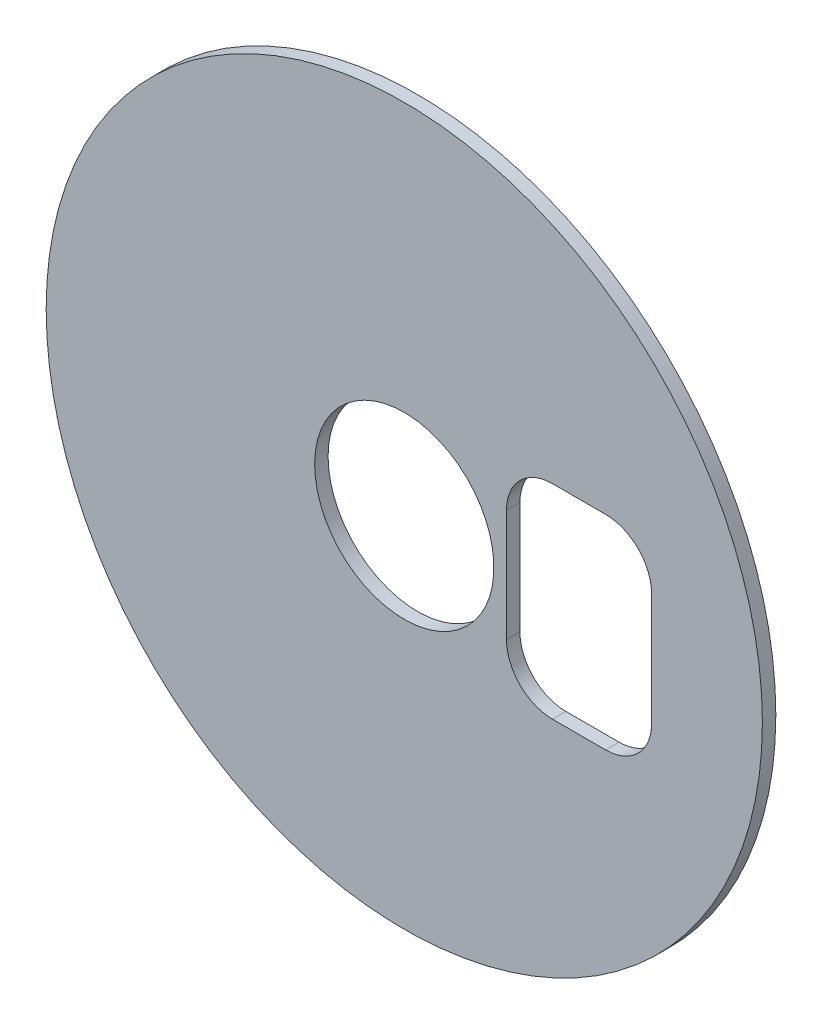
from build123d import *

# Parameters (mm, degrees)
SKETCH1_R      = 20.2946
SKETCH1_R_2    = 5.08
EXTRUDE1_DEPTH = 0.762


with BuildPart() as part:
    # Sketch1 → Extrude1 (new body)
    with BuildSketch(Plane.XY):
        with Locations(Location((0, 0, 0), (0, 0, 180))):
            Circle(SKETCH1_R)
        with Locations(Location((0, 0, 0), (0, 0, 180))):
            Circle(SKETCH1_R_2, mode=Mode.SUBTRACT)
        with BuildLine():
            Line((14.019583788, -3.175), (14.019583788, 3.175))
            ThreePointArc((14.019583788, 3.175), (13.256648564, 5.016888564), (11.41476, 5.779823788))
            Line((11.41476, 5.779823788), (8.39724, 5.779823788))
            ThreePointArc((8.39724, 5.779823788), (6.555351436, 5.016888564), (5.792416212, 3.175))
            Line((5.792416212, 3.175), (5.792416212, -3.175))
            ThreePointArc((5.792416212, -3.175), (6.555351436, -5.016888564), (8.39724, -5.779823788))
            Line((8.39724, -5.779823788), (11.41476, -5.779823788))
            ThreePointArc((11.41476, -5.779823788), (13.256648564, -5.016888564), (14.019583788, -3.175))
        make_face(mode=Mode.SUBTRACT)
    extrude(amount=EXTRUDE1_DEPTH)


solid = part.part
